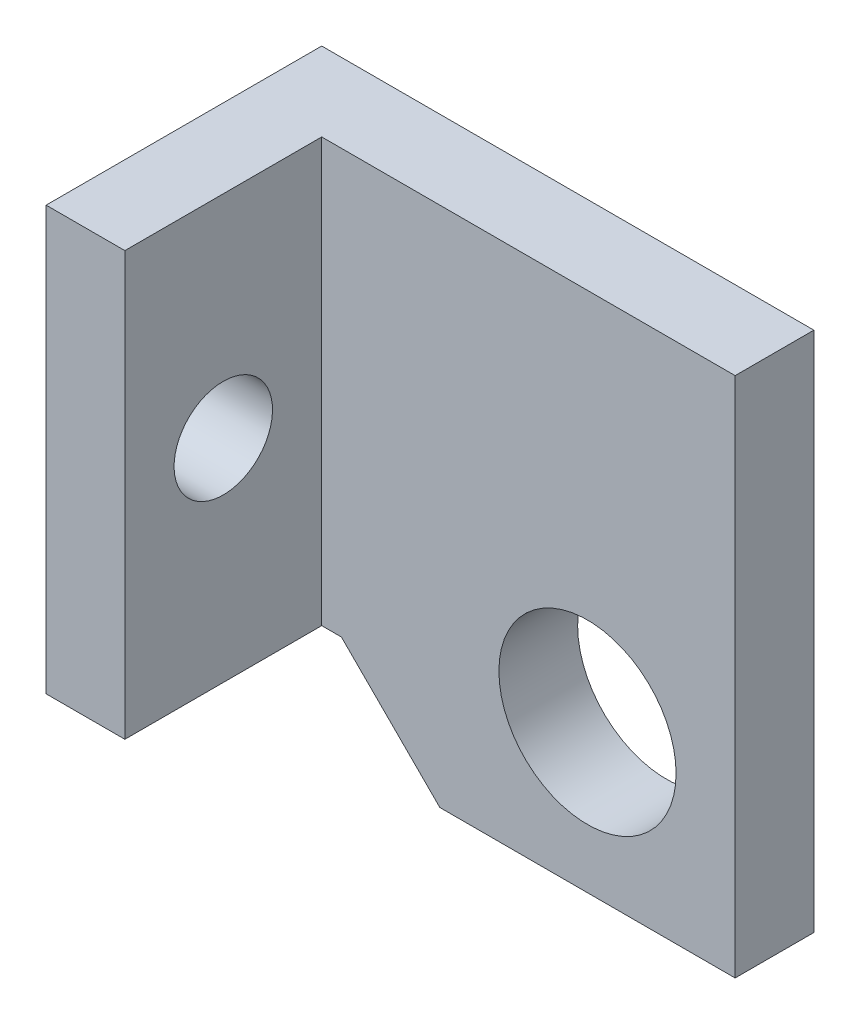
ISO-10303-21;
HEADER;
FILE_DESCRIPTION(('STEP AP214'),'2;1');
FILE_NAME('part.step','',(''),(''),'','','');
FILE_SCHEMA(('AUTOMOTIVE_DESIGN { 1 0 10303 214 1 1 1 1 }'));
ENDSEC;
DATA;
#1=APPLICATION_CONTEXT('core data for automotive mechanical design processes');
#2=APPLICATION_PROTOCOL_DEFINITION('international standard','automotive_design',2000,#1);
#3=PRODUCT_CONTEXT('',#1,'mechanical');
#4=PRODUCT('Part','Part','',(#3));
#5=PRODUCT_RELATED_PRODUCT_CATEGORY('part','',(#4));
#6=PRODUCT_DEFINITION_FORMATION('','',#4);
#7=PRODUCT_DEFINITION_CONTEXT('part definition',#1,'design');
#8=PRODUCT_DEFINITION('design','',#6,#7);
#9=PRODUCT_DEFINITION_SHAPE('','',#8);
#10=(LENGTH_UNIT() NAMED_UNIT(*) SI_UNIT(.MILLI.,.METRE.));
#11=(NAMED_UNIT(*) PLANE_ANGLE_UNIT() SI_UNIT($,.RADIAN.));
#12=(NAMED_UNIT(*) SI_UNIT($,.STERADIAN.) SOLID_ANGLE_UNIT());
#13=UNCERTAINTY_MEASURE_WITH_UNIT(LENGTH_MEASURE(1.E-05),#10,'distance_accuracy_value','');
#14=(GEOMETRIC_REPRESENTATION_CONTEXT(3) GLOBAL_UNCERTAINTY_ASSIGNED_CONTEXT((#13)) GLOBAL_UNIT_ASSIGNED_CONTEXT((#10,
#11,#12)) REPRESENTATION_CONTEXT('',''));
#15=CARTESIAN_POINT('',(0.,0.,0.));
#16=DIRECTION('',(0.,0.,1.));
#17=DIRECTION('',(1.,0.,0.));
#18=AXIS2_PLACEMENT_3D('',#15,#16,#17);
#19=CARTESIAN_POINT('',(-35.,38.,8.));
#20=DIRECTION('',(0.,0.,1.));
#21=DIRECTION('',(1.,0.,0.));
#22=AXIS2_PLACEMENT_3D('',#19,#20,#21);
#23=PLANE('',#22);
#24=DIRECTION('',(0.,1.,0.));
#25=VECTOR('',#24,1.);
#26=CARTESIAN_POINT('',(-27.,38.,8.));
#27=LINE('',#26,#25);
#28=CARTESIAN_POINT('',(-27.,-5.,8.));
#29=VERTEX_POINT('',#28);
#30=CARTESIAN_POINT('',(-27.,38.,8.));
#31=VERTEX_POINT('',#30);
#32=EDGE_CURVE('E50',#29,#31,#27,.T.);
#33=ORIENTED_EDGE('',*,*,#32,.F.);
#34=DIRECTION('',(1.,0.,0.));
#35=VECTOR('',#34,1.);
#36=CARTESIAN_POINT('',(-35.,-5.,8.));
#37=LINE('',#36,#35);
#38=CARTESIAN_POINT('',(-25.,-5.,8.));
#39=VERTEX_POINT('',#38);
#40=EDGE_CURVE('E102',#29,#39,#37,.T.);
#41=ORIENTED_EDGE('',*,*,#40,.T.);
#42=DIRECTION('',(0.707106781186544,-0.707106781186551,0.));
#43=VECTOR('',#42,1.);
#44=CARTESIAN_POINT('',(-25.,-5.,8.));
#45=LINE('',#44,#43);
#46=CARTESIAN_POINT('',(-15.0000000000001,-15.,8.));
#47=VERTEX_POINT('',#46);
#48=EDGE_CURVE('E173',#39,#47,#45,.T.);
#49=ORIENTED_EDGE('',*,*,#48,.T.);
#50=DIRECTION('',(1.,0.,0.));
#51=VECTOR('',#50,1.);
#52=CARTESIAN_POINT('',(-15.0000000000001,-15.,8.));
#53=LINE('',#52,#51);
#54=CARTESIAN_POINT('',(15.,-15.,8.));
#55=VERTEX_POINT('',#54);
#56=EDGE_CURVE('E172',#47,#55,#53,.T.);
#57=ORIENTED_EDGE('',*,*,#56,.T.);
#58=DIRECTION('',(0.,1.,0.));
#59=VECTOR('',#58,1.);
#60=CARTESIAN_POINT('',(15.,-15.,8.));
#61=LINE('',#60,#59);
#62=CARTESIAN_POINT('',(15.,38.,8.));
#63=VERTEX_POINT('',#62);
#64=EDGE_CURVE('E56',#55,#63,#61,.T.);
#65=ORIENTED_EDGE('',*,*,#64,.T.);
#66=DIRECTION('',(-1.,0.,0.));
#67=VECTOR('',#66,1.);
#68=CARTESIAN_POINT('',(15.,38.,8.));
#69=LINE('',#68,#67);
#70=EDGE_CURVE('E97',#63,#31,#69,.T.);
#71=ORIENTED_EDGE('',*,*,#70,.T.);
#72=EDGE_LOOP('',(#33,#41,#49,#57,#65,#71));
#73=FACE_BOUND('',#72,.T.);
#74=CARTESIAN_POINT('',(0.,0.,8.));
#75=DIRECTION('',(0.,0.,1.));
#76=DIRECTION('',(1.,0.,0.));
#77=AXIS2_PLACEMENT_3D('',#74,#75,#76);
#78=CIRCLE('',#77,9.);
#79=CARTESIAN_POINT('',(9.,0.,8.));
#80=VERTEX_POINT('',#79);
#81=EDGE_CURVE('E140',#80,#80,#78,.T.);
#82=ORIENTED_EDGE('',*,*,#81,.F.);
#83=EDGE_LOOP('',(#82));
#84=FACE_BOUND('',#83,.T.);
#85=ADVANCED_FACE('F33',(#73,#84),#23,.T.);
#86=CARTESIAN_POINT('',(-35.,38.,0.));
#87=DIRECTION('',(0.,0.,1.));
#88=DIRECTION('',(1.,0.,0.));
#89=AXIS2_PLACEMENT_3D('',#86,#87,#88);
#90=PLANE('',#89);
#91=DIRECTION('',(-1.,0.,0.));
#92=VECTOR('',#91,1.);
#93=CARTESIAN_POINT('',(15.,38.,0.));
#94=LINE('',#93,#92);
#95=CARTESIAN_POINT('',(15.,38.,0.));
#96=VERTEX_POINT('',#95);
#97=CARTESIAN_POINT('',(-35.,38.,0.));
#98=VERTEX_POINT('',#97);
#99=EDGE_CURVE('E143',#96,#98,#94,.T.);
#100=ORIENTED_EDGE('',*,*,#99,.F.);
#101=DIRECTION('',(0.,1.,0.));
#102=VECTOR('',#101,1.);
#103=CARTESIAN_POINT('',(15.,-15.,0.));
#104=LINE('',#103,#102);
#105=CARTESIAN_POINT('',(15.,-15.,0.));
#106=VERTEX_POINT('',#105);
#107=EDGE_CURVE('E103',#106,#96,#104,.T.);
#108=ORIENTED_EDGE('',*,*,#107,.F.);
#109=DIRECTION('',(1.,0.,0.));
#110=VECTOR('',#109,1.);
#111=CARTESIAN_POINT('',(-15.0000000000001,-15.,0.));
#112=LINE('',#111,#110);
#113=CARTESIAN_POINT('',(-15.0000000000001,-15.,0.));
#114=VERTEX_POINT('',#113);
#115=EDGE_CURVE('E151',#114,#106,#112,.T.);
#116=ORIENTED_EDGE('',*,*,#115,.F.);
#117=DIRECTION('',(0.707106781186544,-0.707106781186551,0.));
#118=VECTOR('',#117,1.);
#119=CARTESIAN_POINT('',(-25.,-5.,0.));
#120=LINE('',#119,#118);
#121=CARTESIAN_POINT('',(-25.,-5.,0.));
#122=VERTEX_POINT('',#121);
#123=EDGE_CURVE('E149',#122,#114,#120,.T.);
#124=ORIENTED_EDGE('',*,*,#123,.F.);
#125=DIRECTION('',(1.,0.,0.));
#126=VECTOR('',#125,1.);
#127=CARTESIAN_POINT('',(-35.,-5.,0.));
#128=LINE('',#127,#126);
#129=CARTESIAN_POINT('',(-35.,-5.,0.));
#130=VERTEX_POINT('',#129);
#131=EDGE_CURVE('E147',#130,#122,#128,.T.);
#132=ORIENTED_EDGE('',*,*,#131,.F.);
#133=DIRECTION('',(0.,-1.,0.));
#134=VECTOR('',#133,1.);
#135=CARTESIAN_POINT('',(-35.,38.,0.));
#136=LINE('',#135,#134);
#137=EDGE_CURVE('E145',#98,#130,#136,.T.);
#138=ORIENTED_EDGE('',*,*,#137,.F.);
#139=EDGE_LOOP('',(#100,#108,#116,#124,#132,#138));
#140=FACE_BOUND('',#139,.T.);
#141=CARTESIAN_POINT('',(0.,0.,0.));
#142=DIRECTION('',(0.,0.,1.));
#143=DIRECTION('',(1.,0.,0.));
#144=AXIS2_PLACEMENT_3D('',#141,#142,#143);
#145=CIRCLE('',#144,9.);
#146=CARTESIAN_POINT('',(9.,0.,0.));
#147=VERTEX_POINT('',#146);
#148=EDGE_CURVE('E121',#147,#147,#145,.T.);
#149=ORIENTED_EDGE('',*,*,#148,.T.);
#150=EDGE_LOOP('',(#149));
#151=FACE_BOUND('',#150,.T.);
#152=ADVANCED_FACE('F193',(#140,#151),#90,.F.);
#153=CARTESIAN_POINT('',(15.,38.,8.));
#154=DIRECTION('',(0.,-1.,0.));
#155=DIRECTION('',(0.,0.,-1.));
#156=AXIS2_PLACEMENT_3D('',#153,#154,#155);
#157=PLANE('',#156);
#158=ORIENTED_EDGE('',*,*,#99,.T.);
#159=DIRECTION('',(0.,0.,-1.));
#160=VECTOR('',#159,1.);
#161=CARTESIAN_POINT('',(-35.,38.,8.));
#162=LINE('',#161,#160);
#163=CARTESIAN_POINT('',(-35.,38.,28.));
#164=VERTEX_POINT('',#163);
#165=EDGE_CURVE('E11',#164,#98,#162,.T.);
#166=ORIENTED_EDGE('',*,*,#165,.F.);
#167=DIRECTION('',(-1.,0.,0.));
#168=VECTOR('',#167,1.);
#169=CARTESIAN_POINT('',(-35.,38.,28.));
#170=LINE('',#169,#168);
#171=CARTESIAN_POINT('',(-27.,38.,28.));
#172=VERTEX_POINT('',#171);
#173=EDGE_CURVE('E119',#172,#164,#170,.T.);
#174=ORIENTED_EDGE('',*,*,#173,.F.);
#175=DIRECTION('',(0.,0.,-1.));
#176=VECTOR('',#175,1.);
#177=CARTESIAN_POINT('',(-27.,38.,28.));
#178=LINE('',#177,#176);
#179=EDGE_CURVE('E110',#172,#31,#178,.T.);
#180=ORIENTED_EDGE('',*,*,#179,.T.);
#181=ORIENTED_EDGE('',*,*,#70,.F.);
#182=DIRECTION('',(0.,0.,-1.));
#183=VECTOR('',#182,1.);
#184=CARTESIAN_POINT('',(15.,38.,8.));
#185=LINE('',#184,#183);
#186=EDGE_CURVE('E169',#63,#96,#185,.T.);
#187=ORIENTED_EDGE('',*,*,#186,.T.);
#188=EDGE_LOOP('',(#158,#166,#174,#180,#181,#187));
#189=FACE_BOUND('',#188,.T.);
#190=ADVANCED_FACE('F35',(#189),#157,.F.);
#191=CARTESIAN_POINT('',(-35.,38.,8.));
#192=DIRECTION('',(1.,0.,0.));
#193=DIRECTION('',(0.,0.,-1.));
#194=AXIS2_PLACEMENT_3D('',#191,#192,#193);
#195=PLANE('',#194);
#196=CARTESIAN_POINT('',(-35.,16.5,18.));
#197=DIRECTION('',(1.,0.,0.));
#198=DIRECTION('',(0.,0.,-1.));
#199=AXIS2_PLACEMENT_3D('',#196,#197,#198);
#200=CIRCLE('',#199,5.);
#201=CARTESIAN_POINT('',(-35.,16.5,13.));
#202=VERTEX_POINT('',#201);
#203=EDGE_CURVE('E115',#202,#202,#200,.F.);
#204=ORIENTED_EDGE('',*,*,#203,.F.);
#205=EDGE_LOOP('',(#204));
#206=FACE_BOUND('',#205,.T.);
#207=ORIENTED_EDGE('',*,*,#137,.T.);
#208=DIRECTION('',(0.,0.,-1.));
#209=VECTOR('',#208,1.);
#210=CARTESIAN_POINT('',(-35.,-5.,8.));
#211=LINE('',#210,#209);
#212=CARTESIAN_POINT('',(-35.,-5.,28.));
#213=VERTEX_POINT('',#212);
#214=EDGE_CURVE('E42',#213,#130,#211,.T.);
#215=ORIENTED_EDGE('',*,*,#214,.F.);
#216=DIRECTION('',(0.,-1.,0.));
#217=VECTOR('',#216,1.);
#218=CARTESIAN_POINT('',(-35.,38.,28.));
#219=LINE('',#218,#217);
#220=EDGE_CURVE('E114',#164,#213,#219,.T.);
#221=ORIENTED_EDGE('',*,*,#220,.F.);
#222=ORIENTED_EDGE('',*,*,#165,.T.);
#223=EDGE_LOOP('',(#207,#215,#221,#222));
#224=FACE_BOUND('',#223,.T.);
#225=ADVANCED_FACE('F197',(#206,#224),#195,.F.);
#226=CARTESIAN_POINT('',(-35.,-5.,8.));
#227=DIRECTION('',(0.,1.,0.));
#228=DIRECTION('',(-1.,0.,0.));
#229=AXIS2_PLACEMENT_3D('',#226,#227,#228);
#230=PLANE('',#229);
#231=ORIENTED_EDGE('',*,*,#131,.T.);
#232=DIRECTION('',(0.,0.,-1.));
#233=VECTOR('',#232,1.);
#234=CARTESIAN_POINT('',(-25.,-5.,8.));
#235=LINE('',#234,#233);
#236=EDGE_CURVE('E160',#39,#122,#235,.T.);
#237=ORIENTED_EDGE('',*,*,#236,.F.);
#238=ORIENTED_EDGE('',*,*,#40,.F.);
#239=DIRECTION('',(0.,0.,-1.));
#240=VECTOR('',#239,1.);
#241=CARTESIAN_POINT('',(-27.,-5.,28.));
#242=LINE('',#241,#240);
#243=CARTESIAN_POINT('',(-27.,-5.,28.));
#244=VERTEX_POINT('',#243);
#245=EDGE_CURVE('E113',#244,#29,#242,.T.);
#246=ORIENTED_EDGE('',*,*,#245,.F.);
#247=DIRECTION('',(1.,0.,0.));
#248=VECTOR('',#247,1.);
#249=CARTESIAN_POINT('',(-35.,-5.,28.));
#250=LINE('',#249,#248);
#251=EDGE_CURVE('E135',#213,#244,#250,.T.);
#252=ORIENTED_EDGE('',*,*,#251,.F.);
#253=ORIENTED_EDGE('',*,*,#214,.T.);
#254=EDGE_LOOP('',(#231,#237,#238,#246,#252,#253));
#255=FACE_BOUND('',#254,.T.);
#256=ADVANCED_FACE('F178',(#255),#230,.F.);
#257=CARTESIAN_POINT('',(-25.,-5.,8.));
#258=DIRECTION('',(0.707106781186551,0.707106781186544,0.));
#259=DIRECTION('',(-0.707106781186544,0.707106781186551,0.));
#260=AXIS2_PLACEMENT_3D('',#257,#258,#259);
#261=PLANE('',#260);
#262=ORIENTED_EDGE('',*,*,#123,.T.);
#263=DIRECTION('',(0.,0.,-1.));
#264=VECTOR('',#263,1.);
#265=CARTESIAN_POINT('',(-15.0000000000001,-15.,8.));
#266=LINE('',#265,#264);
#267=EDGE_CURVE('E163',#47,#114,#266,.T.);
#268=ORIENTED_EDGE('',*,*,#267,.F.);
#269=ORIENTED_EDGE('',*,*,#48,.F.);
#270=ORIENTED_EDGE('',*,*,#236,.T.);
#271=EDGE_LOOP('',(#262,#268,#269,#270));
#272=FACE_BOUND('',#271,.T.);
#273=ADVANCED_FACE('F182',(#272),#261,.F.);
#274=CARTESIAN_POINT('',(-15.0000000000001,-15.,8.));
#275=DIRECTION('',(0.,1.,0.));
#276=DIRECTION('',(0.,0.,1.));
#277=AXIS2_PLACEMENT_3D('',#274,#275,#276);
#278=PLANE('',#277);
#279=ORIENTED_EDGE('',*,*,#115,.T.);
#280=DIRECTION('',(0.,0.,-1.));
#281=VECTOR('',#280,1.);
#282=CARTESIAN_POINT('',(15.,-15.,8.));
#283=LINE('',#282,#281);
#284=EDGE_CURVE('E166',#55,#106,#283,.T.);
#285=ORIENTED_EDGE('',*,*,#284,.F.);
#286=ORIENTED_EDGE('',*,*,#56,.F.);
#287=ORIENTED_EDGE('',*,*,#267,.T.);
#288=EDGE_LOOP('',(#279,#285,#286,#287));
#289=FACE_BOUND('',#288,.T.);
#290=ADVANCED_FACE('F187',(#289),#278,.F.);
#291=CARTESIAN_POINT('',(15.,-15.,8.));
#292=DIRECTION('',(-1.,0.,0.));
#293=DIRECTION('',(0.,0.,1.));
#294=AXIS2_PLACEMENT_3D('',#291,#292,#293);
#295=PLANE('',#294);
#296=ORIENTED_EDGE('',*,*,#107,.T.);
#297=ORIENTED_EDGE('',*,*,#186,.F.);
#298=ORIENTED_EDGE('',*,*,#64,.F.);
#299=ORIENTED_EDGE('',*,*,#284,.T.);
#300=EDGE_LOOP('',(#296,#297,#298,#299));
#301=FACE_BOUND('',#300,.T.);
#302=ADVANCED_FACE('F190',(#301),#295,.F.);
#303=CARTESIAN_POINT('',(0.,0.,8.));
#304=DIRECTION('',(0.,0.,-1.));
#305=DIRECTION('',(-1.,0.,0.));
#306=AXIS2_PLACEMENT_3D('',#303,#304,#305);
#307=CYLINDRICAL_SURFACE('',#306,9.);
#308=ORIENTED_EDGE('',*,*,#81,.T.);
#309=EDGE_LOOP('',(#308));
#310=FACE_BOUND('',#309,.T.);
#311=ORIENTED_EDGE('',*,*,#148,.F.);
#312=EDGE_LOOP('',(#311));
#313=FACE_BOUND('',#312,.T.);
#314=ADVANCED_FACE('F210',(#310,#313),#307,.F.);
#315=CARTESIAN_POINT('',(-27.,38.,28.));
#316=DIRECTION('',(-1.,0.,0.));
#317=DIRECTION('',(0.,-1.,0.));
#318=AXIS2_PLACEMENT_3D('',#315,#316,#317);
#319=PLANE('',#318);
#320=CARTESIAN_POINT('',(-27.,16.5,18.));
#321=DIRECTION('',(1.,0.,0.));
#322=DIRECTION('',(0.,1.,0.));
#323=AXIS2_PLACEMENT_3D('',#320,#321,#322);
#324=CIRCLE('',#323,5.);
#325=CARTESIAN_POINT('',(-27.,21.5,18.));
#326=VERTEX_POINT('',#325);
#327=EDGE_CURVE('E236',#326,#326,#324,.T.);
#328=ORIENTED_EDGE('',*,*,#327,.F.);
#329=EDGE_LOOP('',(#328));
#330=FACE_BOUND('',#329,.T.);
#331=ORIENTED_EDGE('',*,*,#32,.T.);
#332=ORIENTED_EDGE('',*,*,#179,.F.);
#333=DIRECTION('',(0.,1.,0.));
#334=VECTOR('',#333,1.);
#335=CARTESIAN_POINT('',(-27.,38.,28.));
#336=LINE('',#335,#334);
#337=EDGE_CURVE('E122',#244,#172,#336,.T.);
#338=ORIENTED_EDGE('',*,*,#337,.F.);
#339=ORIENTED_EDGE('',*,*,#245,.T.);
#340=EDGE_LOOP('',(#331,#332,#338,#339));
#341=FACE_BOUND('',#340,.T.);
#342=ADVANCED_FACE('F108',(#330,#341),#319,.F.);
#343=CARTESIAN_POINT('',(-35.,38.,28.));
#344=DIRECTION('',(0.,0.,1.));
#345=DIRECTION('',(1.,0.,0.));
#346=AXIS2_PLACEMENT_3D('',#343,#344,#345);
#347=PLANE('',#346);
#348=ORIENTED_EDGE('',*,*,#220,.T.);
#349=ORIENTED_EDGE('',*,*,#251,.T.);
#350=ORIENTED_EDGE('',*,*,#337,.T.);
#351=ORIENTED_EDGE('',*,*,#173,.T.);
#352=EDGE_LOOP('',(#348,#349,#350,#351));
#353=FACE_BOUND('',#352,.T.);
#354=ADVANCED_FACE('F199',(#353),#347,.T.);
#355=CARTESIAN_POINT('',(-35.001,16.5,18.));
#356=DIRECTION('',(1.,0.,0.));
#357=DIRECTION('',(0.,1.,0.));
#358=AXIS2_PLACEMENT_3D('',#355,#356,#357);
#359=CYLINDRICAL_SURFACE('',#358,5.);
#360=ORIENTED_EDGE('',*,*,#327,.T.);
#361=EDGE_LOOP('',(#360));
#362=FACE_BOUND('',#361,.T.);
#363=ORIENTED_EDGE('',*,*,#203,.T.);
#364=EDGE_LOOP('',(#363));
#365=FACE_BOUND('',#364,.T.);
#366=ADVANCED_FACE('F202',(#362,#365),#359,.F.);
#367=CLOSED_SHELL('',(#85,#152,#190,#225,#256,#273,#290,#302,#314,#342,#354,#366));
#368=MANIFOLD_SOLID_BREP('B2',#367);
#369=ADVANCED_BREP_SHAPE_REPRESENTATION('',(#18,#368),#14);
#370=SHAPE_DEFINITION_REPRESENTATION(#9,#369);
ENDSEC;
END-ISO-10303-21;
